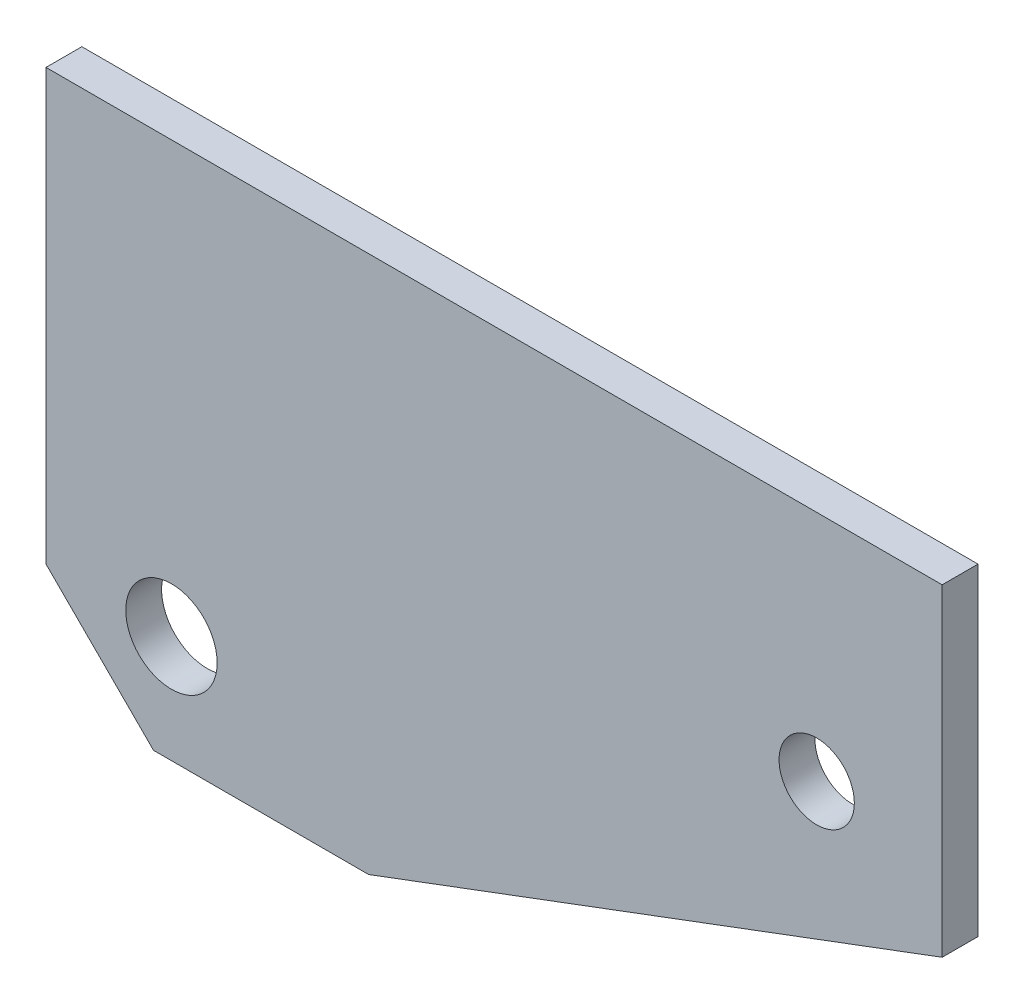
from build123d import *

# Parameters (mm, degrees)
ESQUISSE1_R          = 10.5
ESQUISSE1_R_2        = 12.75
BASE_EXTRUSION_DEPTH = 10


with BuildPart() as part:
    # Esquisse1 → Base-Extrusion (new body)
    with BuildSketch(Plane.XY):
        Polygon((0, -120), (30, -150), (90, -150), (250, -90), (250, 0), (0, 0), align=None)
        with Locations((215, -65)):
            Circle(ESQUISSE1_R, mode=Mode.SUBTRACT)
        with Locations((35, -120)):
            Circle(ESQUISSE1_R_2, mode=Mode.SUBTRACT)
    extrude(amount=BASE_EXTRUSION_DEPTH)


solid = part.part
